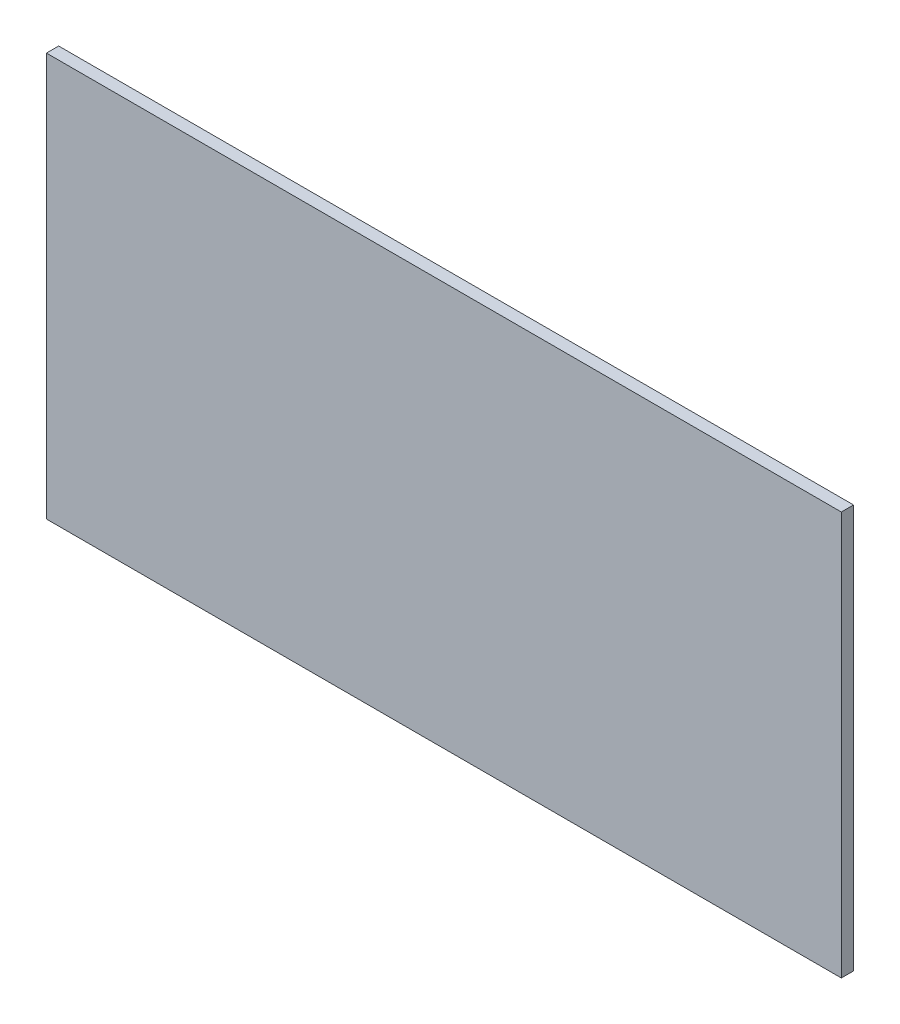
from build123d import *

# Parameters (mm, degrees)
SKETCH1_W      = 825.5
SKETCH1_H      = 419.1
EXTRUDE1_DEPTH = 6.35


with BuildPart() as part:
    # Sketch1 → Extrude1 (new, symmetric)
    with BuildSketch(Plane.XY):
        Rectangle(SKETCH1_W, SKETCH1_H)
    extrude(amount=EXTRUDE1_DEPTH, both=True)


solid = part.part
